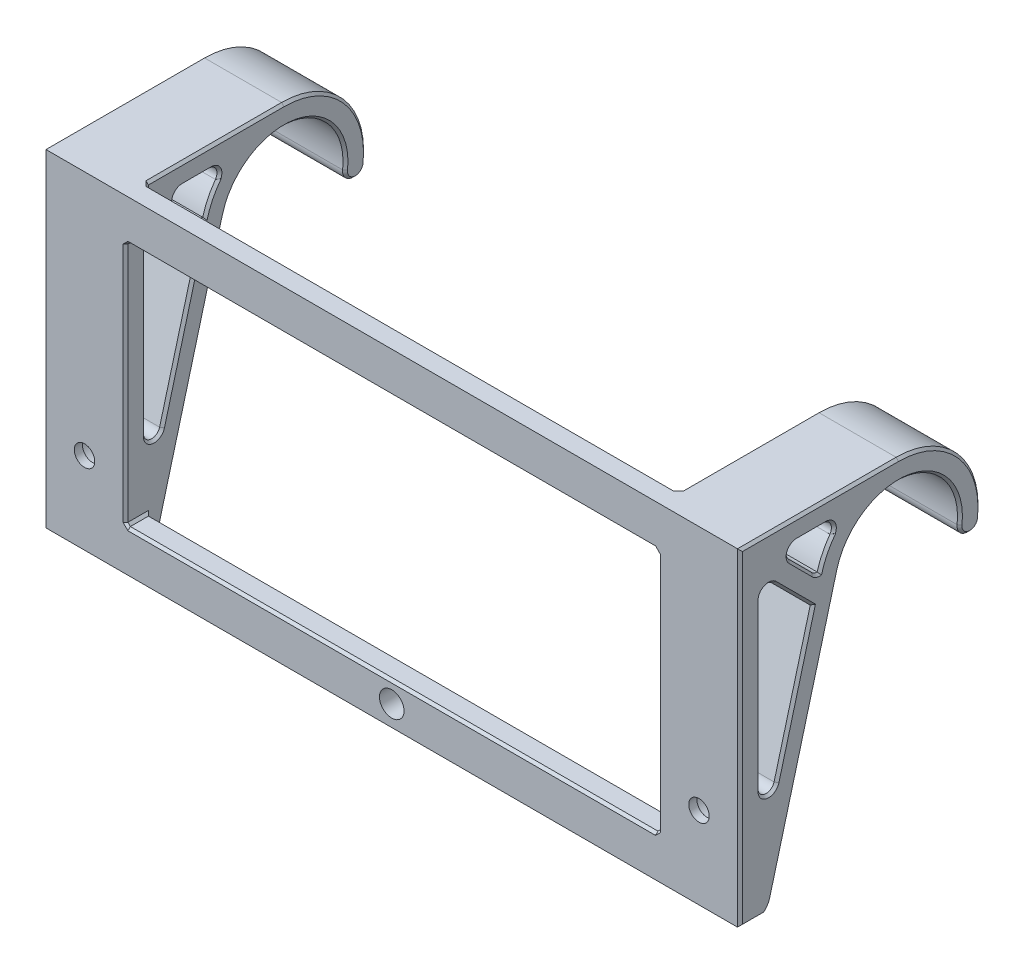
from build123d import *

# Parameters (mm, degrees)
BOSS_EXTRUDE1_DEPTH = 170
SKETCH5_W           = 311.890541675
SKETCH5_H           = 166.963210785
SKETCH5_W_2         = 20
SKETCH5_H_2         = 80.000022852
CUT_EXTRUDE1_DEPTH  = 170
SKETCH6_W           = 10
SKETCH6_H           = 5
BOSS_EXTRUDE2_DEPTH = 140
SKETCH7_R           = 4
CUT_EXTRUDE2_DEPTH  = 140
SKETCH8_R           = 4
SKETCH8_R_2         = 2
BOSS_EXTRUDE3_DEPTH = 2
SKETCH9_R           = 4.5
CUT_EXTRUDE3_DEPTH  = 25
SKETCH10_R          = 4.5
CUT_EXTRUDE4_DEPTH  = 21
SKETCH11_W          = 5
SKETCH11_H          = 10
BOSS_EXTRUDE4_DEPTH = 160
SKETCH12_W          = 24.94442307
SKETCH12_H          = 41.745671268
CUT_EXTRUDE5_DEPTH  = 130
SKETCH13_W          = 5
SKETCH13_H          = 10
BOSS_EXTRUDE5_DEPTH = 140
SKETCH14_R          = 2
CUT_EXTRUDE6_DEPTH  = 140
CHAMFER8_SIZE       = 0.6
SKETCH15_R          = 3
CUT_EXTRUDE7_DEPTH  = 10
SKETCH16_R          = 2.5
CUT_EXTRUDE8_DEPTH  = 10


with BuildPart() as part:
    # Sketch1 → Boss-Extrude1 (new body)
    with BuildSketch(Plane(origin=(0, 0, 0), x_dir=(0, 0, -1), z_dir=(1, 0, 0))):
        with BuildLine():
            Line((-14.145847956, -46.068040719), (-14.145847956, -54.068149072))
            ThreePointArc((-14.145847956, -54.068149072), (-9.512629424, -54.793857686), (-6.316211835, -51.362198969))
            Line((-6.316211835, -51.362198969), (10.075942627, 9.814159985))
            ThreePointArc((10.075942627, 9.814159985), (27.370720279, 20.667107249), (39.466548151, 4.217586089))
            ThreePointArc((39.466548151, 4.217586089), (41.664452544, 1.448250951), (44.433787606, 3.64615544))
            ThreePointArc((44.433787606, 3.64615544), (39.493233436, 19.241375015), (24.564831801, 25.93187378))
            Line((24.564831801, 25.93187378), (-14.145847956, 25.93187378))
            Line((-14.145847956, 25.93187378), (-14.145847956, -46.068040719))
        make_face()
        with BuildLine():
            ThreePointArc((-9.145847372, -27.309179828), (-7.406901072, -29.292071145), (-5.213996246, -27.826820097))
            Line((-5.213996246, -27.826820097), (3.61754667, 5.132946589))
            Line((3.61754667, 5.132946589), (-5.731633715, 14.482126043))
            ThreePointArc((-5.731633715, 14.482126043), (-7.911214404, 14.915671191), (-9.145847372, 13.067911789))
            Line((-9.145847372, 13.067911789), (-9.145847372, -27.309179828))
        make_face(mode=Mode.SUBTRACT)
        with BuildLine():
            Line((8.395136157, 17.747613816), (8.413830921, 17.727850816))
            ThreePointArc((8.413830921, 17.727850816), (6.565602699, 14.651256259), (5.297012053, 11.293867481))
            ThreePointArc((5.297012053, 11.293867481), (4.564017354, 11.456898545), (3.942809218, 11.878752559))
            Line((3.942809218, 11.878752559), (-1.696100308, 17.517659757))
            ThreePointArc((-1.696100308, 17.517659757), (-2.129645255, 19.697240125), (-0.281886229, 20.931873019))
            Line((-0.281886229, 20.931873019), (6.78345109, 20.931873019))
            ThreePointArc((6.78345109, 20.931873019), (8.567900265, 19.835056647), (8.395136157, 17.747613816))
        make_face(mode=Mode.SUBTRACT)
    extrude(amount=BOSS_EXTRUDE1_DEPTH)

    # Sketch5 → Cut-Extrude1 (cut)
    with BuildSketch(Plane.XY.offset(14.145847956)):
        with Locations((112.138074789, -18.424442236)):
            Rectangle(SKETCH5_W, SKETCH5_H)
        with Locations((160, -14.068137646)):
            Rectangle(SKETCH5_W_2, SKETCH5_H_2, mode=Mode.SUBTRACT)
        with Locations((10, -14.068137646)):
            Rectangle(SKETCH5_W_2, SKETCH5_H_2, mode=Mode.SUBTRACT)
    extrude(amount=-CUT_EXTRUDE1_DEPTH, mode=Mode.SUBTRACT)


with BuildPart() as cut_extrude1_piece_1:
    # of the separate pieces the step leaves, piece 1, a body of its own (cut_extrude1_pieces)
    add(part.part.solids().sort_by_distance((0, 25.93187378, -24.564831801))[0])



with BuildPart() as cut_extrude1_piece_2:
    # of the separate pieces the step leaves, piece 2, a body of its own (cut_extrude1_pieces)
    add(part.part.solids().sort_by_distance((150, 25.93187378, 14.145847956))[0])


with BuildPart() as cut_extrude1_piece_1_1:
    add(cut_extrude1_piece_1.part)

    add(cut_extrude1_piece_2.part)  # Boss-Extrude2 merges Cut-Extrude1 piece 2
    # Sketch6 → Boss-Extrude2 (add)
    with BuildSketch(Plane(origin=(20, 0, 0), x_dir=(0, 0, -1), z_dir=(1, 0, 0))):
        with Locations((-9.145847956, 23.43187378)):
            Rectangle(SKETCH6_W, SKETCH6_H)
    extrude(amount=BOSS_EXTRUDE2_DEPTH)

    # Sketch7 → Cut-Extrude2 (cut)
    with BuildSketch(Plane.XY.offset(14.145847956)):
        with Locations((160, -34.068149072)):
            Circle(SKETCH7_R)
        with Locations((10, -34.068149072)):
            Circle(SKETCH7_R)
    extrude(amount=-CUT_EXTRUDE2_DEPTH, mode=Mode.SUBTRACT)

    # Sketch8 → Boss-Extrude3 (add)
    # profile 1 of 2: a face of its own
    with BuildSketch(Plane.XY.offset(14.145847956)):
        with Locations((160, -34.068149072)):
            Circle(SKETCH8_R)
        with Locations((160, -34.068149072)):
            Circle(SKETCH8_R_2, mode=Mode.SUBTRACT)
    # profile 2 of 2: a face of its own
    with BuildSketch(Plane.XY.offset(14.145847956)):
        with Locations((10, -34.068149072)):
            Circle(SKETCH8_R)
        with Locations((10, -34.068149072)):
            Circle(SKETCH8_R_2, mode=Mode.SUBTRACT)
    extrude(amount=-BOSS_EXTRUDE3_DEPTH)

    # Sketch9 → Cut-Extrude3 (cut)
    with BuildSketch(Plane(origin=(0, 0, 12.145847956), x_dir=(-1, 0, 0), z_dir=(0, 0, -1))):
        with Locations(Location((-10, -34.068149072, 0), (0, 0, 270))):
            Circle(SKETCH9_R)
    extrude(amount=CUT_EXTRUDE3_DEPTH, mode=Mode.SUBTRACT)

    # Sketch10 → Cut-Extrude4 (cut)
    with BuildSketch(Plane(origin=(0, 0, 12.145847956), x_dir=(-1, 0, 0), z_dir=(0, 0, -1))):
        with Locations(Location((-160, -34.068149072, 0), (0, 0, 270))):
            Circle(SKETCH10_R)
    extrude(amount=CUT_EXTRUDE4_DEPTH, mode=Mode.SUBTRACT)

    # Sketch11 → Boss-Extrude4 (add)
    with BuildSketch(Plane(origin=(170, 0, 0), x_dir=(0, 0, -1), z_dir=(1, 0, 0))):
        with Locations((-11.645847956, -49.068149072)):
            Rectangle(SKETCH11_W, SKETCH11_H)
    extrude(amount=-BOSS_EXTRUDE4_DEPTH)

    # Sketch12 → Cut-Extrude5 (cut)
    with BuildSketch(Plane(origin=(20, 0, 0), x_dir=(0, 0, -1), z_dir=(1, 0, 0))):
        with Locations((-8.688937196, 32.264182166)):
            Rectangle(SKETCH12_W, SKETCH12_H)
    extrude(amount=CUT_EXTRUDE5_DEPTH, mode=Mode.SUBTRACT)

    # Sketch13 → Boss-Extrude5 (add)
    with BuildSketch(Plane(origin=(20, 0, 0), x_dir=(0, 0, -1), z_dir=(1, 0, 0))):
        with Locations((-11.645847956, 20.93187378)):
            Rectangle(SKETCH13_W, SKETCH13_H)
    extrude(amount=BOSS_EXTRUDE5_DEPTH)

    # Sketch14 → Cut-Extrude6 (cut)
    with BuildSketch(Plane.XY.offset(14.145847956)):
        with Locations((85, -49.068149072)):
            Circle(SKETCH14_R)
    extrude(amount=-CUT_EXTRUDE6_DEPTH, mode=Mode.SUBTRACT)

    # Chamfer8
    chamfer8_edges = [cut_extrude1_piece_1_1.edges().sort_by_distance(p)[0] for p in [
        (150, 11.456898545, -4.564017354),
        (20, -14.068137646, 14.145847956),
        (20, -44.068149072, 11.645847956),
        (170, 11.456898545, -4.564017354),
        (85, -44.068149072, 14.145847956),
        (150, -44.068149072, 11.645847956),
        (150, -49.068149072, 9.145847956),
        (20, -49.068149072, 9.145847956),
        (85, -54.068149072, 9.145847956),
        (150, 14.698206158, -1.123354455),
        (170, 14.698206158, -1.123354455),
        (150, 19.697240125, 2.129645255),
        (170, 19.697240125, 2.129645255),
        (150, -14.068137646, 14.145847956),
        (150, 15.93187378, 11.645847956),
        (150, 20.93187378, 9.145847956),
        (85, 15.93187378, 14.145847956),
        (20, 15.93187378, 11.645847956),
        (20, 20.93187378, 9.145847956),
        (85, 25.93187378, 9.145847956),
        (160, -51.362198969, 6.316211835),
        (150, -20.774019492, -1.879865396),
        (170, -20.774019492, -1.879865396),
        (150, 20.667107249, -27.370720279),
        (170, 20.667107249, -27.370720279),
        (150, -29.292071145, 7.406901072),
        (170, -29.292071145, 7.406901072),
        (150, -7.12063402, 9.145847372),
        (170, -7.12063402, 9.145847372),
        (150, 14.915671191, 7.911214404),
        (170, 14.915671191, 7.911214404),
        (150, 9.807536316, 1.057043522),
        (170, 9.807536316, 1.057043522),
        (150, 25.93187378, -7.709491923),
        (170, 25.93187378, -5.209491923),
        (150, -11.346936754, 0.798224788),
        (170, -11.346936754, 0.798224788),
        (20, 17.737732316, -8.404483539),
        (20, 14.651256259, -6.565602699),
        (20, 20.931873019, -3.25078243),
        (20, -52.868801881, 7.003847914),
        (20, 1.448250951, -41.664452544),
        (20, 19.241375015, -39.493233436),
        (20, 25.93187378, -7.709491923),
        (0, 19.835056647, -8.567900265),
        (0, 19.697240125, 2.129645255),
        (0, 14.698206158, -1.123354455),
        (0, 11.456898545, -4.564017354),
        (0, -29.292071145, 7.406901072),
        (0, -11.346936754, 0.798224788),
        (0, 9.807536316, 1.057043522),
        (0, 14.915671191, 7.911214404),
        (0, -7.12063402, 9.145847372),
        (0, 25.93187378, -5.209491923),
        (0, 20.667107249, -27.370720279),
        (0, -20.774019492, -1.879865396),
        (150, 19.835056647, -8.567900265),
        (20, 19.835056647, -8.567900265),
        (20, -11.346936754, 0.798224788),
        (20, 9.807536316, 1.057043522),
        (20, 14.915671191, 7.911214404),
        (20, -7.12063402, 9.145847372),
        (170, 19.835056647, -8.567900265),
        (20, -29.292071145, 7.406901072),
        (0, 19.241375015, -39.493233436),
        (0, 1.448250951, -41.664452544),
        (20, 20.667107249, -27.370720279),
        (20, -20.774019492, -1.879865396),
        (170, 17.737732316, -8.404483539),
        (10, -51.362198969, 6.316211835),
        (0, -52.868801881, 7.003847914),
        (0, -14.068137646, 14.145847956),
        (0, 20.931873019, -3.25078243),
        (20, 19.697240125, 2.129645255),
        (170, 14.651256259, -6.565602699),
        (20, 14.698206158, -1.123354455),
        (20, 11.456898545, -4.564017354),
        (0, 14.651256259, -6.565602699),
        (0, 17.737732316, -8.404483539),
        (170, 20.931873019, -3.25078243),
        (20, -54.068149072, 8.645869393),
        (0, -54.068149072, 11.145869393),
        (170, -14.068137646, 14.145847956),
        (170, -54.068149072, 11.145869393),
        (170, -52.868801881, 7.003847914),
        (170, 1.448250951, -41.664452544),
        (170, 19.241375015, -39.493233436),
        (150, 17.737732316, -8.404483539),
        (150, 20.931873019, -3.25078243),
        (150, 14.651256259, -6.565602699),
        (150, -52.868801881, 7.003847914),
        (150, -54.068149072, 8.645869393),
        (150, 19.241375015, -39.493233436),
        (150, 1.448250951, -41.664452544),
    ]]
    chamfer(chamfer8_edges, length=CHAMFER8_SIZE)

    # Sketch15 → Cut-Extrude7 (cut)
    with BuildSketch(Plane(origin=(0, 0, 9.145847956), x_dir=(-1, 0, 0), z_dir=(0, 0, -1))):
        with Locations((-85, -49.068149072)):
            Circle(SKETCH15_R)
    extrude(amount=-CUT_EXTRUDE7_DEPTH, mode=Mode.SUBTRACT)

    # Sketch16 → Cut-Extrude8 (cut)
    with BuildSketch(Plane(origin=(0, 0, 12.145847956), x_dir=(-1, 0, 0), z_dir=(0, 0, -1))):
        with Locations((-10, -34.068149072)):
            Circle(SKETCH16_R)
        with Locations((-160, -34.068149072)):
            Circle(SKETCH16_R)
    extrude(amount=-CUT_EXTRUDE8_DEPTH, mode=Mode.SUBTRACT)


solid = cut_extrude1_piece_1_1.part
